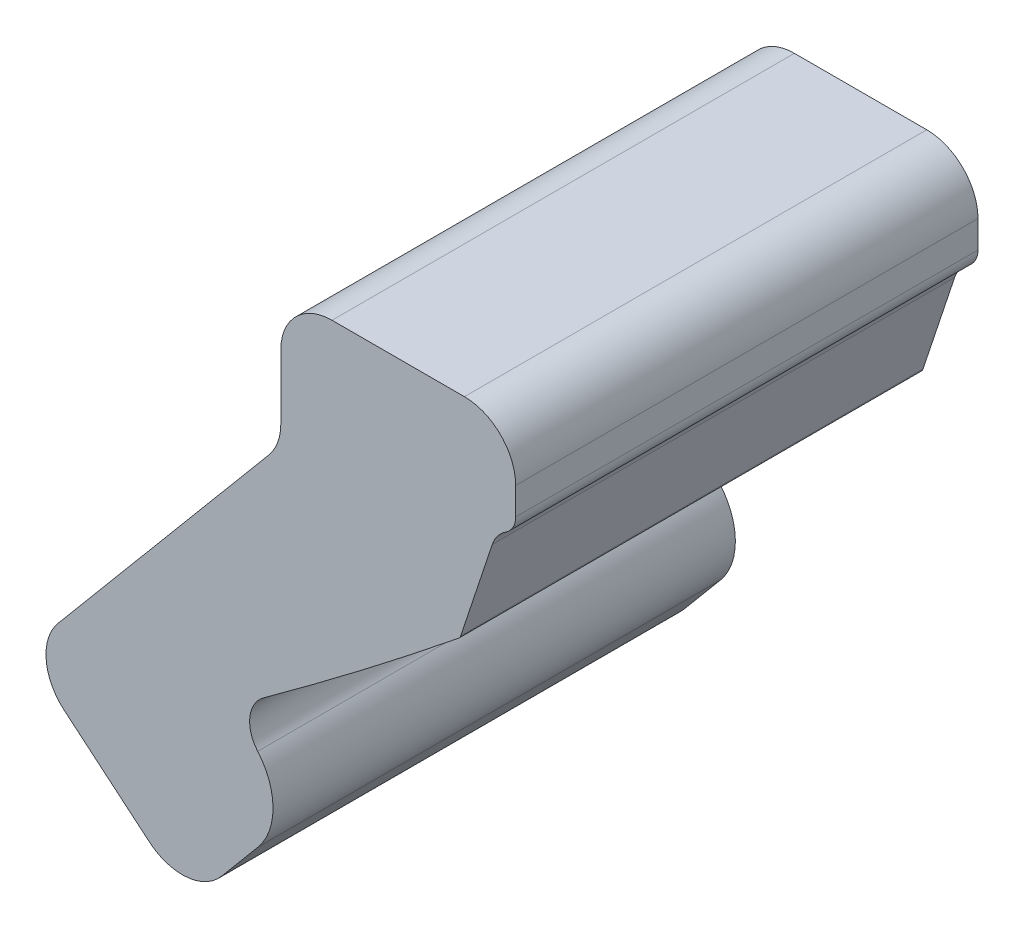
from build123d import *

# Parameters (mm, degrees)
BOSS_EXTRUDE1_DEPTH = 96.393
CUT_EXTRUDE1_DEPTH  = 548.758417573
FILLET1_R           = 3.175
FILLET2_R           = 9.525


with BuildPart() as part:
    # Sketch1 → Boss-Extrude1 (new body)
    with BuildSketch(Plane(origin=(0, 0, 71.9582), x_dir=(-1, 0, 0), z_dir=(0, 0, -1))):
        with BuildLine():
            Line((499.999, -20.819194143), (499.999, -30.347870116))
            ThreePointArc((499.999, -30.347870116), (500.45854223, -32.954063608), (501.781741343, -35.245911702))
            Line((501.781741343, -35.245911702), (533.141258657, -72.618729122))
            ThreePointArc((533.141258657, -72.618729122), (534.895003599, -78.180897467), (532.202041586, -83.354029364))
            Line((532.202041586, -83.354029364), (519.55464783, -93.9664528))
            ThreePointArc((519.55464783, -93.9664528), (513.992479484, -95.720197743), (508.819347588, -93.027235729))
            Line((508.819347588, -93.027235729), (466.856741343, -43.018148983))
            ThreePointArc((466.856741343, -43.018148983), (465.53354223, -40.726300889), (465.074, -38.120107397))
            Line((465.074, -38.120107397), (465.074, -20.819194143))
            ThreePointArc((465.074, -20.819194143), (467.305846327, -15.431040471), (472.694, -13.199194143))
            Line((472.694, -13.199194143), (492.379, -13.199194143))
            ThreePointArc((492.379, -13.199194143), (497.767153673, -15.431040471), (499.999, -20.819194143))
        make_face()
    extrude(amount=BOSS_EXTRUDE1_DEPTH)

    # SurfaceCut1
    split(bisect_by=Plane.XY.offset(3.2), keep=Keep.TOP)

    # Sketch2 → Cut-Extrude1 (cut, through all)
    with BuildSketch(Plane.XY.offset(71.9582)):
        with BuildLine():
            Line((-489.002143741, -69.410011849), (-497.390583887, -79.406965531))
            Line((-497.390583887, -79.406965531), (-502.846787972, -74.828666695))
            ThreePointArc((-502.846787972, -74.828666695), (-504.635549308, -70.806803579), (-502.564505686, -66.922755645))
            ThreePointArc((-502.564505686, -66.922755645), (-487.925544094, -56.028161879), (-473.575646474, -44.75554869))
            ThreePointArc((-473.575646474, -44.75554869), (-473.378806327, -44.543899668), (-473.249529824, -44.285386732))
            Line((-473.249529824, -44.285386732), (-468.55552345, -30.167292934))
            ThreePointArc((-468.55552345, -30.167292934), (-462.212531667, -26.989715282), (-459.034954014, -33.332707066))
            Line((-459.034954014, -33.332707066), (-463.728960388, -47.450800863))
            ThreePointArc((-463.728960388, -47.450800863), (-465.134842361, -50.262129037), (-467.275478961, -52.563812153))
            ThreePointArc((-467.275478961, -52.563812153), (-478.057238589, -61.092116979), (-489.002143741, -69.410011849))
        make_face()
    extrude(amount=-CUT_EXTRUDE1_DEPTH, mode=Mode.SUBTRACT)

    # Fillet1
    fillet1_edges = [part.edges().sort_by_distance(p)[0] for p in [
        (-465.074, -26.89922255, 37.5791),
    ]]
    fillet(fillet1_edges, radius=FILLET1_R)

    # Fillet2
    fillet2_edges = [part.edges().sort_by_distance(p)[0] for p in [
        (-497.390583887, -79.406965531, 37.5791),
    ]]
    fillet(fillet2_edges, radius=FILLET2_R)


solid = part.part
